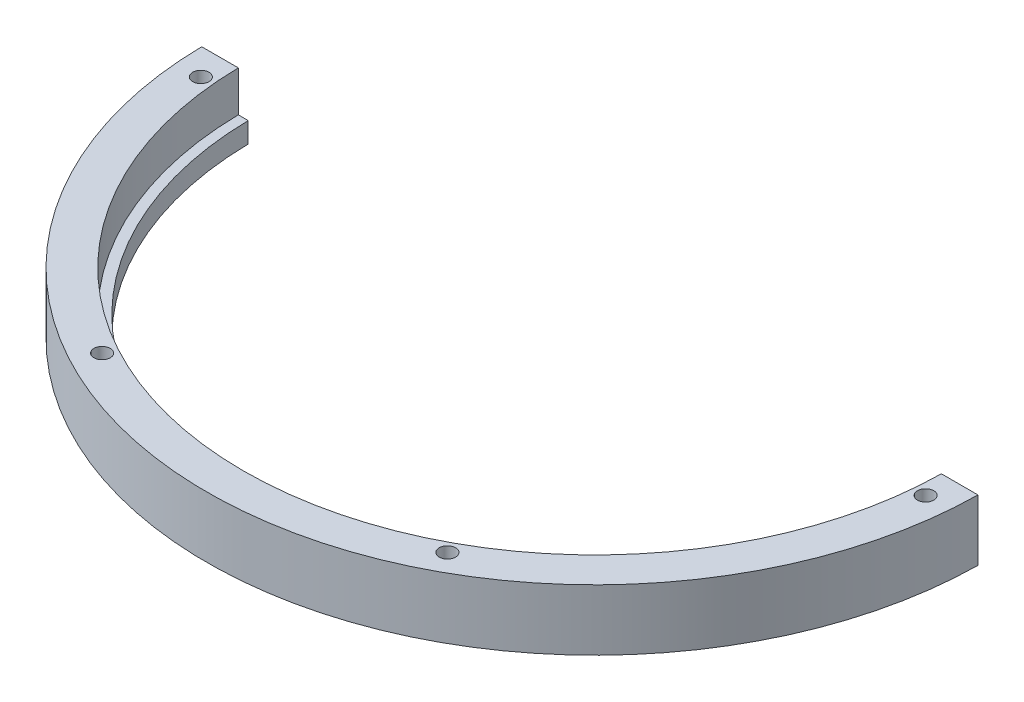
ISO-10303-21;
HEADER;
FILE_DESCRIPTION(('STEP AP214'),'2;1');
FILE_NAME('part.step','',(''),(''),'','','');
FILE_SCHEMA(('AUTOMOTIVE_DESIGN { 1 0 10303 214 1 1 1 1 }'));
ENDSEC;
DATA;
#1=APPLICATION_CONTEXT('core data for automotive mechanical design processes');
#2=APPLICATION_PROTOCOL_DEFINITION('international standard','automotive_design',2000,#1);
#3=PRODUCT_CONTEXT('',#1,'mechanical');
#4=PRODUCT('Part','Part','',(#3));
#5=PRODUCT_RELATED_PRODUCT_CATEGORY('part','',(#4));
#6=PRODUCT_DEFINITION_FORMATION('','',#4);
#7=PRODUCT_DEFINITION_CONTEXT('part definition',#1,'design');
#8=PRODUCT_DEFINITION('design','',#6,#7);
#9=PRODUCT_DEFINITION_SHAPE('','',#8);
#10=(LENGTH_UNIT() NAMED_UNIT(*) SI_UNIT(.MILLI.,.METRE.));
#11=(NAMED_UNIT(*) PLANE_ANGLE_UNIT() SI_UNIT($,.RADIAN.));
#12=(NAMED_UNIT(*) SI_UNIT($,.STERADIAN.) SOLID_ANGLE_UNIT());
#13=UNCERTAINTY_MEASURE_WITH_UNIT(LENGTH_MEASURE(1.E-05),#10,'distance_accuracy_value','');
#14=(GEOMETRIC_REPRESENTATION_CONTEXT(3) GLOBAL_UNCERTAINTY_ASSIGNED_CONTEXT((#13)) GLOBAL_UNIT_ASSIGNED_CONTEXT((#10,
#11,#12)) REPRESENTATION_CONTEXT('',''));
#15=CARTESIAN_POINT('',(0.,0.,0.));
#16=DIRECTION('',(0.,0.,1.));
#17=DIRECTION('',(1.,0.,0.));
#18=AXIS2_PLACEMENT_3D('',#15,#16,#17);
#19=CARTESIAN_POINT('',(0.,0.,0.));
#20=DIRECTION('',(0.,-1.,0.));
#21=DIRECTION('',(0.,0.,-1.));
#22=AXIS2_PLACEMENT_3D('',#19,#20,#21);
#23=CYLINDRICAL_SURFACE('',#22,106.6927);
#24=CARTESIAN_POINT('',(0.,6.35000000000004,0.));
#25=DIRECTION('',(0.,-1.,0.));
#26=DIRECTION('',(0.,0.,-1.));
#27=AXIS2_PLACEMENT_3D('',#24,#25,#26);
#28=CIRCLE('',#27,106.6927);
#29=CARTESIAN_POINT('',(106.680888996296,6.35000000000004,1.5875));
#30=VERTEX_POINT('',#29);
#31=CARTESIAN_POINT('',(-106.680888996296,6.35000000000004,1.5875));
#32=VERTEX_POINT('',#31);
#33=EDGE_CURVE('E141',#30,#32,#28,.T.);
#34=ORIENTED_EDGE('',*,*,#33,.T.);
#35=DIRECTION('',(0.,-1.,0.));
#36=VECTOR('',#35,1.);
#37=CARTESIAN_POINT('',(-106.680888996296,0.,1.5875));
#38=LINE('',#37,#36);
#39=CARTESIAN_POINT('',(-106.680888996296,12.7,1.5875));
#40=VERTEX_POINT('',#39);
#41=EDGE_CURVE('E63',#32,#40,#38,.F.);
#42=ORIENTED_EDGE('',*,*,#41,.T.);
#43=CARTESIAN_POINT('',(0.,12.7,0.));
#44=DIRECTION('',(0.,-1.,0.));
#45=DIRECTION('',(0.,0.,-1.));
#46=AXIS2_PLACEMENT_3D('',#43,#44,#45);
#47=CIRCLE('',#46,106.6927);
#48=CARTESIAN_POINT('',(106.680888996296,12.7,1.5875));
#49=VERTEX_POINT('',#48);
#50=EDGE_CURVE('E11',#49,#40,#47,.T.);
#51=ORIENTED_EDGE('',*,*,#50,.F.);
#52=DIRECTION('',(0.,-1.,0.));
#53=VECTOR('',#52,1.);
#54=CARTESIAN_POINT('',(106.680888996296,0.,1.5875));
#55=LINE('',#54,#53);
#56=EDGE_CURVE('E166',#49,#30,#55,.T.);
#57=ORIENTED_EDGE('',*,*,#56,.T.);
#58=EDGE_LOOP('',(#34,#42,#51,#57));
#59=FACE_BOUND('',#58,.T.);
#60=ADVANCED_FACE('F44',(#59),#23,.F.);
#61=CARTESIAN_POINT('',(109.791499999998,12.7,-7.66669946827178E-13));
#62=DIRECTION('',(0.,-1.,0.));
#63=DIRECTION('',(0.,0.,-1.));
#64=AXIS2_PLACEMENT_3D('',#61,#62,#63);
#65=PLANE('',#64);
#66=CARTESIAN_POINT('',(0.,12.7,0.));
#67=DIRECTION('',(0.,-1.,0.));
#68=DIRECTION('',(0.,0.,-1.));
#69=AXIS2_PLACEMENT_3D('',#66,#67,#68);
#70=CIRCLE('',#69,109.791499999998);
#71=CARTESIAN_POINT('',(109.780022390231,12.7,1.5875));
#72=VERTEX_POINT('',#71);
#73=CARTESIAN_POINT('',(-109.780022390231,12.7,1.5875));
#74=VERTEX_POINT('',#73);
#75=EDGE_CURVE('E53',#72,#74,#70,.T.);
#76=ORIENTED_EDGE('',*,*,#75,.F.);
#77=DIRECTION('',(-1.,0.,0.));
#78=VECTOR('',#77,1.);
#79=CARTESIAN_POINT('',(109.791499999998,12.7,1.5875));
#80=LINE('',#79,#78);
#81=EDGE_CURVE('E155',#72,#49,#80,.T.);
#82=ORIENTED_EDGE('',*,*,#81,.T.);
#83=ORIENTED_EDGE('',*,*,#50,.T.);
#84=EDGE_CURVE('E157',#40,#74,#80,.T.);
#85=ORIENTED_EDGE('',*,*,#84,.T.);
#86=EDGE_LOOP('',(#76,#82,#83,#85));
#87=FACE_BOUND('',#86,.T.);
#88=ADVANCED_FACE('F46',(#87),#65,.F.);
#89=CARTESIAN_POINT('',(0.,0.,0.));
#90=DIRECTION('',(0.,-1.,0.));
#91=DIRECTION('',(0.,0.,-1.));
#92=AXIS2_PLACEMENT_3D('',#89,#90,#91);
#93=CYLINDRICAL_SURFACE('',#92,109.791499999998);
#94=ORIENTED_EDGE('',*,*,#75,.T.);
#95=DIRECTION('',(0.,-1.,0.));
#96=VECTOR('',#95,1.);
#97=CARTESIAN_POINT('',(-109.780022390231,0.,1.5875));
#98=LINE('',#97,#96);
#99=CARTESIAN_POINT('',(-109.780022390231,25.4000000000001,1.5875));
#100=VERTEX_POINT('',#99);
#101=EDGE_CURVE('E151',#74,#100,#98,.F.);
#102=ORIENTED_EDGE('',*,*,#101,.T.);
#103=CARTESIAN_POINT('',(0.,25.4000000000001,0.));
#104=DIRECTION('',(0.,-1.,0.));
#105=DIRECTION('',(0.,0.,-1.));
#106=AXIS2_PLACEMENT_3D('',#103,#104,#105);
#107=CIRCLE('',#106,109.791499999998);
#108=CARTESIAN_POINT('',(109.780022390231,25.4000000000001,1.5875));
#109=VERTEX_POINT('',#108);
#110=EDGE_CURVE('E128',#109,#100,#107,.T.);
#111=ORIENTED_EDGE('',*,*,#110,.F.);
#112=DIRECTION('',(0.,-1.,0.));
#113=VECTOR('',#112,1.);
#114=CARTESIAN_POINT('',(109.780022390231,0.,1.5875));
#115=LINE('',#114,#113);
#116=EDGE_CURVE('E119',#109,#72,#115,.T.);
#117=ORIENTED_EDGE('',*,*,#116,.T.);
#118=EDGE_LOOP('',(#94,#102,#111,#117));
#119=FACE_BOUND('',#118,.T.);
#120=ADVANCED_FACE('F150',(#119),#93,.F.);
#121=CARTESIAN_POINT('',(121.221499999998,25.4000000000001,-8.46485210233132E-13));
#122=DIRECTION('',(0.,-1.,0.));
#123=DIRECTION('',(0.,0.,-1.));
#124=AXIS2_PLACEMENT_3D('',#121,#122,#123);
#125=PLANE('',#124);
#126=CARTESIAN_POINT('',(113.169211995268,25.4000000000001,9.90102310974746));
#127=DIRECTION('',(0.,1.,0.));
#128=DIRECTION('',(0.,0.,1.));
#129=AXIS2_PLACEMENT_3D('',#126,#127,#128);
#130=CIRCLE('',#129,2.55270000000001);
#131=CARTESIAN_POINT('',(113.169211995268,25.4000000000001,12.4537231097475));
#132=VERTEX_POINT('',#131);
#133=EDGE_CURVE('E163',#132,#132,#130,.T.);
#134=ORIENTED_EDGE('',*,*,#133,.F.);
#135=EDGE_LOOP('',(#134));
#136=FACE_BOUND('',#135,.T.);
#137=CARTESIAN_POINT('',(53.9153139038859,25.4000000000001,99.9921983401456));
#138=DIRECTION('',(0.,1.,0.));
#139=DIRECTION('',(0.,0.,1.));
#140=AXIS2_PLACEMENT_3D('',#137,#138,#139);
#141=CIRCLE('',#140,2.5527);
#142=CARTESIAN_POINT('',(53.9153139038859,25.4000000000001,102.544898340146));
#143=VERTEX_POINT('',#142);
#144=EDGE_CURVE('E205',#143,#143,#141,.T.);
#145=ORIENTED_EDGE('',*,*,#144,.F.);
#146=EDGE_LOOP('',(#145));
#147=FACE_BOUND('',#146,.T.);
#148=CARTESIAN_POINT('',(-113.169211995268,25.4000000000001,9.90102310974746));
#149=DIRECTION('',(0.,1.,0.));
#150=DIRECTION('',(0.,0.,1.));
#151=AXIS2_PLACEMENT_3D('',#148,#149,#150);
#152=CIRCLE('',#151,2.55270000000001);
#153=CARTESIAN_POINT('',(-113.169211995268,25.4000000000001,12.4537231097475));
#154=VERTEX_POINT('',#153);
#155=EDGE_CURVE('E198',#154,#154,#152,.T.);
#156=ORIENTED_EDGE('',*,*,#155,.F.);
#157=EDGE_LOOP('',(#156));
#158=FACE_BOUND('',#157,.T.);
#159=CARTESIAN_POINT('',(-53.9153139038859,25.4000000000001,99.9921983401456));
#160=DIRECTION('',(0.,1.,0.));
#161=DIRECTION('',(0.,0.,1.));
#162=AXIS2_PLACEMENT_3D('',#159,#160,#161);
#163=CIRCLE('',#162,2.5527);
#164=CARTESIAN_POINT('',(-53.9153139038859,25.4000000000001,102.544898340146));
#165=VERTEX_POINT('',#164);
#166=EDGE_CURVE('E188',#165,#165,#163,.T.);
#167=ORIENTED_EDGE('',*,*,#166,.F.);
#168=EDGE_LOOP('',(#167));
#169=FACE_BOUND('',#168,.T.);
#170=CARTESIAN_POINT('',(0.,25.4000000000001,0.));
#171=DIRECTION('',(0.,-1.,0.));
#172=DIRECTION('',(0.,0.,-1.));
#173=AXIS2_PLACEMENT_3D('',#170,#171,#172);
#174=CIRCLE('',#173,121.221499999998);
#175=CARTESIAN_POINT('',(121.211104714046,25.4000000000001,1.5875));
#176=VERTEX_POINT('',#175);
#177=CARTESIAN_POINT('',(-121.211104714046,25.4000000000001,1.5875));
#178=VERTEX_POINT('',#177);
#179=EDGE_CURVE('E126',#176,#178,#174,.T.);
#180=ORIENTED_EDGE('',*,*,#179,.F.);
#181=DIRECTION('',(1.,0.,0.));
#182=VECTOR('',#181,1.);
#183=CARTESIAN_POINT('',(-136.840434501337,25.4000000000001,1.5875));
#184=LINE('',#183,#182);
#185=EDGE_CURVE('E131',#109,#176,#184,.T.);
#186=ORIENTED_EDGE('',*,*,#185,.F.);
#187=ORIENTED_EDGE('',*,*,#110,.T.);
#188=EDGE_CURVE('E111',#178,#100,#184,.T.);
#189=ORIENTED_EDGE('',*,*,#188,.F.);
#190=EDGE_LOOP('',(#180,#186,#187,#189));
#191=FACE_BOUND('',#190,.T.);
#192=ADVANCED_FACE('F124',(#136,#147,#158,#169,#191),#125,.F.);
#193=CARTESIAN_POINT('',(0.,0.,0.));
#194=DIRECTION('',(0.,-1.,0.));
#195=DIRECTION('',(0.,0.,-1.));
#196=AXIS2_PLACEMENT_3D('',#193,#194,#195);
#197=CYLINDRICAL_SURFACE('',#196,121.221499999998);
#198=ORIENTED_EDGE('',*,*,#179,.T.);
#199=DIRECTION('',(0.,-1.,0.));
#200=VECTOR('',#199,1.);
#201=CARTESIAN_POINT('',(-121.211104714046,0.,1.5875));
#202=LINE('',#201,#200);
#203=CARTESIAN_POINT('',(-121.211104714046,6.35000000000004,1.5875));
#204=VERTEX_POINT('',#203);
#205=EDGE_CURVE('E108',#178,#204,#202,.T.);
#206=ORIENTED_EDGE('',*,*,#205,.T.);
#207=CARTESIAN_POINT('',(0.,6.35000000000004,0.));
#208=DIRECTION('',(0.,-1.,0.));
#209=DIRECTION('',(0.,0.,-1.));
#210=AXIS2_PLACEMENT_3D('',#207,#208,#209);
#211=CIRCLE('',#210,121.221499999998);
#212=CARTESIAN_POINT('',(121.211104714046,6.35000000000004,1.5875));
#213=VERTEX_POINT('',#212);
#214=EDGE_CURVE('E135',#213,#204,#211,.T.);
#215=ORIENTED_EDGE('',*,*,#214,.F.);
#216=DIRECTION('',(0.,-1.,0.));
#217=VECTOR('',#216,1.);
#218=CARTESIAN_POINT('',(121.211104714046,0.,1.5875));
#219=LINE('',#218,#217);
#220=EDGE_CURVE('E73',#213,#176,#219,.F.);
#221=ORIENTED_EDGE('',*,*,#220,.T.);
#222=EDGE_LOOP('',(#198,#206,#215,#221));
#223=FACE_BOUND('',#222,.T.);
#224=ADVANCED_FACE('F133',(#223),#197,.T.);
#225=CARTESIAN_POINT('',(121.221499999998,6.35000000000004,-8.46485210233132E-13));
#226=DIRECTION('',(0.,1.,0.));
#227=DIRECTION('',(0.,0.,1.));
#228=AXIS2_PLACEMENT_3D('',#225,#226,#227);
#229=PLANE('',#228);
#230=CARTESIAN_POINT('',(113.169211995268,6.35000000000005,9.90102310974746));
#231=DIRECTION('',(0.,1.,0.));
#232=DIRECTION('',(0.,0.,1.));
#233=AXIS2_PLACEMENT_3D('',#230,#231,#232);
#234=CIRCLE('',#233,2.55269999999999);
#235=CARTESIAN_POINT('',(113.169211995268,6.35000000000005,12.4537231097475));
#236=VERTEX_POINT('',#235);
#237=EDGE_CURVE('E209',#236,#236,#234,.T.);
#238=ORIENTED_EDGE('',*,*,#237,.T.);
#239=EDGE_LOOP('',(#238));
#240=FACE_BOUND('',#239,.T.);
#241=CARTESIAN_POINT('',(53.9153139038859,6.35000000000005,99.9921983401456));
#242=DIRECTION('',(0.,1.,0.));
#243=DIRECTION('',(0.,0.,1.));
#244=AXIS2_PLACEMENT_3D('',#241,#242,#243);
#245=CIRCLE('',#244,2.5527);
#246=CARTESIAN_POINT('',(53.9153139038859,6.35000000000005,102.544898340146));
#247=VERTEX_POINT('',#246);
#248=EDGE_CURVE('E201',#247,#247,#245,.T.);
#249=ORIENTED_EDGE('',*,*,#248,.T.);
#250=EDGE_LOOP('',(#249));
#251=FACE_BOUND('',#250,.T.);
#252=CARTESIAN_POINT('',(-113.169211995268,6.35000000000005,9.90102310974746));
#253=DIRECTION('',(0.,1.,0.));
#254=DIRECTION('',(0.,0.,1.));
#255=AXIS2_PLACEMENT_3D('',#252,#253,#254);
#256=CIRCLE('',#255,2.55269999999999);
#257=CARTESIAN_POINT('',(-113.169211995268,6.35000000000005,12.4537231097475));
#258=VERTEX_POINT('',#257);
#259=EDGE_CURVE('E194',#258,#258,#256,.T.);
#260=ORIENTED_EDGE('',*,*,#259,.T.);
#261=EDGE_LOOP('',(#260));
#262=FACE_BOUND('',#261,.T.);
#263=CARTESIAN_POINT('',(-53.9153139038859,6.35000000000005,99.9921983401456));
#264=DIRECTION('',(0.,1.,0.));
#265=DIRECTION('',(0.,0.,1.));
#266=AXIS2_PLACEMENT_3D('',#263,#264,#265);
#267=CIRCLE('',#266,2.5527);
#268=CARTESIAN_POINT('',(-53.9153139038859,6.35000000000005,102.544898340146));
#269=VERTEX_POINT('',#268);
#270=EDGE_CURVE('E185',#269,#269,#267,.T.);
#271=ORIENTED_EDGE('',*,*,#270,.T.);
#272=EDGE_LOOP('',(#271));
#273=FACE_BOUND('',#272,.T.);
#274=ORIENTED_EDGE('',*,*,#214,.T.);
#275=DIRECTION('',(1.,0.,0.));
#276=VECTOR('',#275,1.);
#277=CARTESIAN_POINT('',(-136.840434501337,6.35000000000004,1.5875));
#278=LINE('',#277,#276);
#279=EDGE_CURVE('E113',#204,#32,#278,.T.);
#280=ORIENTED_EDGE('',*,*,#279,.T.);
#281=ORIENTED_EDGE('',*,*,#33,.F.);
#282=EDGE_CURVE('E130',#30,#213,#278,.T.);
#283=ORIENTED_EDGE('',*,*,#282,.T.);
#284=EDGE_LOOP('',(#274,#280,#281,#283));
#285=FACE_BOUND('',#284,.T.);
#286=ADVANCED_FACE('F183',(#240,#251,#262,#273,#285),#229,.F.);
#287=CARTESIAN_POINT('',(-53.9153139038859,25.4000000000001,99.9921983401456));
#288=DIRECTION('',(0.,1.,0.));
#289=DIRECTION('',(0.,0.,1.));
#290=AXIS2_PLACEMENT_3D('',#287,#288,#289);
#291=CYLINDRICAL_SURFACE('',#290,2.5527);
#292=ORIENTED_EDGE('',*,*,#270,.F.);
#293=EDGE_LOOP('',(#292));
#294=FACE_BOUND('',#293,.T.);
#295=ORIENTED_EDGE('',*,*,#166,.T.);
#296=EDGE_LOOP('',(#295));
#297=FACE_BOUND('',#296,.T.);
#298=ADVANCED_FACE('F226',(#294,#297),#291,.F.);
#299=CARTESIAN_POINT('',(-113.169211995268,25.4000000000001,9.90102310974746));
#300=DIRECTION('',(0.,1.,0.));
#301=DIRECTION('',(0.,0.,1.));
#302=AXIS2_PLACEMENT_3D('',#299,#300,#301);
#303=CYLINDRICAL_SURFACE('',#302,2.5527);
#304=ORIENTED_EDGE('',*,*,#259,.F.);
#305=EDGE_LOOP('',(#304));
#306=FACE_BOUND('',#305,.T.);
#307=ORIENTED_EDGE('',*,*,#155,.T.);
#308=EDGE_LOOP('',(#307));
#309=FACE_BOUND('',#308,.T.);
#310=ADVANCED_FACE('F228',(#306,#309),#303,.F.);
#311=CARTESIAN_POINT('',(53.9153139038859,25.4000000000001,99.9921983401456));
#312=DIRECTION('',(0.,1.,0.));
#313=DIRECTION('',(0.,0.,1.));
#314=AXIS2_PLACEMENT_3D('',#311,#312,#313);
#315=CYLINDRICAL_SURFACE('',#314,2.5527);
#316=ORIENTED_EDGE('',*,*,#248,.F.);
#317=EDGE_LOOP('',(#316));
#318=FACE_BOUND('',#317,.T.);
#319=ORIENTED_EDGE('',*,*,#144,.T.);
#320=EDGE_LOOP('',(#319));
#321=FACE_BOUND('',#320,.T.);
#322=ADVANCED_FACE('F235',(#318,#321),#315,.F.);
#323=CARTESIAN_POINT('',(113.169211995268,25.4000000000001,9.90102310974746));
#324=DIRECTION('',(0.,1.,0.));
#325=DIRECTION('',(0.,0.,1.));
#326=AXIS2_PLACEMENT_3D('',#323,#324,#325);
#327=CYLINDRICAL_SURFACE('',#326,2.5527);
#328=ORIENTED_EDGE('',*,*,#237,.F.);
#329=EDGE_LOOP('',(#328));
#330=FACE_BOUND('',#329,.T.);
#331=ORIENTED_EDGE('',*,*,#133,.T.);
#332=EDGE_LOOP('',(#331));
#333=FACE_BOUND('',#332,.T.);
#334=ADVANCED_FACE('F215',(#330,#333),#327,.F.);
#335=CARTESIAN_POINT('',(-136.840434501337,6.35000000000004,1.5875));
#336=DIRECTION('',(0.,0.,1.));
#337=DIRECTION('',(1.,0.,0.));
#338=AXIS2_PLACEMENT_3D('',#335,#336,#337);
#339=PLANE('',#338);
#340=ORIENTED_EDGE('',*,*,#81,.F.);
#341=ORIENTED_EDGE('',*,*,#116,.F.);
#342=ORIENTED_EDGE('',*,*,#185,.T.);
#343=ORIENTED_EDGE('',*,*,#220,.F.);
#344=ORIENTED_EDGE('',*,*,#282,.F.);
#345=ORIENTED_EDGE('',*,*,#56,.F.);
#346=EDGE_LOOP('',(#340,#341,#342,#343,#344,#345));
#347=FACE_BOUND('',#346,.T.);
#348=ADVANCED_FACE('F268',(#347),#339,.F.);
#349=ORIENTED_EDGE('',*,*,#279,.F.);
#350=ORIENTED_EDGE('',*,*,#205,.F.);
#351=ORIENTED_EDGE('',*,*,#188,.T.);
#352=ORIENTED_EDGE('',*,*,#101,.F.);
#353=ORIENTED_EDGE('',*,*,#84,.F.);
#354=ORIENTED_EDGE('',*,*,#41,.F.);
#355=EDGE_LOOP('',(#349,#350,#351,#352,#353,#354));
#356=FACE_BOUND('',#355,.T.);
#357=ADVANCED_FACE('F110',(#356),#339,.F.);
#358=CLOSED_SHELL('',(#60,#88,#120,#192,#224,#286,#298,#310,#322,#334,#348,#357));
#359=MANIFOLD_SOLID_BREP('B2',#358);
#360=ADVANCED_BREP_SHAPE_REPRESENTATION('',(#18,#359),#14);
#361=SHAPE_DEFINITION_REPRESENTATION(#9,#360);
ENDSEC;
END-ISO-10303-21;
